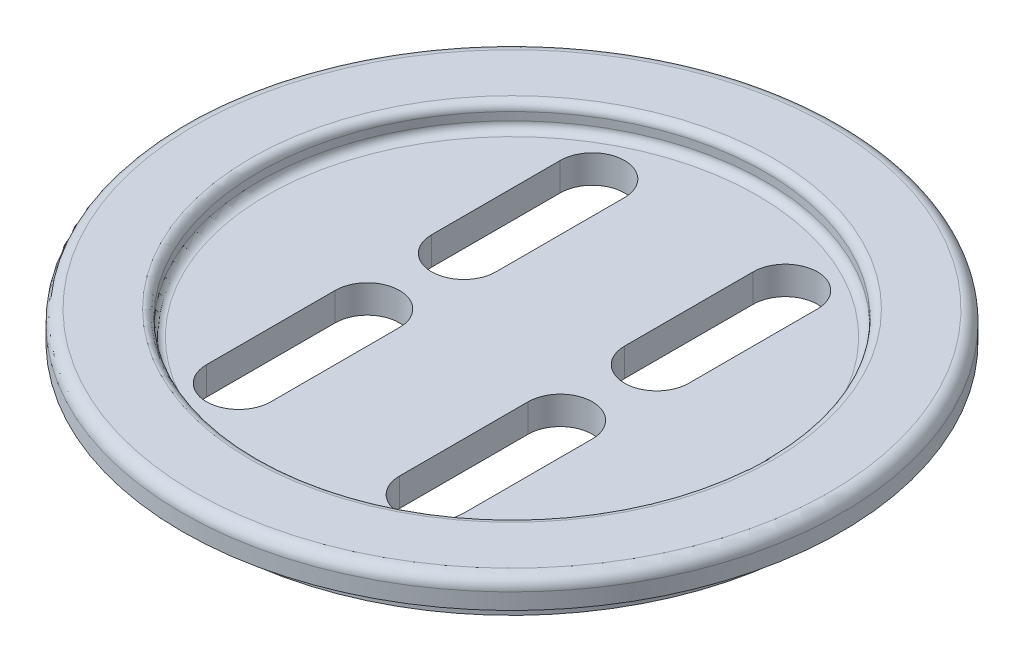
ISO-10303-21;
HEADER;
FILE_DESCRIPTION(('STEP AP214'),'2;1');
FILE_NAME('part.step','',(''),(''),'','','');
FILE_SCHEMA(('AUTOMOTIVE_DESIGN { 1 0 10303 214 1 1 1 1 }'));
ENDSEC;
DATA;
#1=APPLICATION_CONTEXT('core data for automotive mechanical design processes');
#2=APPLICATION_PROTOCOL_DEFINITION('international standard','automotive_design',2000,#1);
#3=PRODUCT_CONTEXT('',#1,'mechanical');
#4=PRODUCT('Part','Part','',(#3));
#5=PRODUCT_RELATED_PRODUCT_CATEGORY('part','',(#4));
#6=PRODUCT_DEFINITION_FORMATION('','',#4);
#7=PRODUCT_DEFINITION_CONTEXT('part definition',#1,'design');
#8=PRODUCT_DEFINITION('design','',#6,#7);
#9=PRODUCT_DEFINITION_SHAPE('','',#8);
#10=(LENGTH_UNIT() NAMED_UNIT(*) SI_UNIT(.MILLI.,.METRE.));
#11=(NAMED_UNIT(*) PLANE_ANGLE_UNIT() SI_UNIT($,.RADIAN.));
#12=(NAMED_UNIT(*) SI_UNIT($,.STERADIAN.) SOLID_ANGLE_UNIT());
#13=UNCERTAINTY_MEASURE_WITH_UNIT(LENGTH_MEASURE(1.E-05),#10,'distance_accuracy_value','');
#14=(GEOMETRIC_REPRESENTATION_CONTEXT(3) GLOBAL_UNCERTAINTY_ASSIGNED_CONTEXT((#13)) GLOBAL_UNIT_ASSIGNED_CONTEXT((#10,
#11,#12)) REPRESENTATION_CONTEXT('',''));
#15=CARTESIAN_POINT('',(0.,0.,0.));
#16=DIRECTION('',(0.,0.,1.));
#17=DIRECTION('',(1.,0.,0.));
#18=AXIS2_PLACEMENT_3D('',#15,#16,#17);
#19=CARTESIAN_POINT('',(0.,0.,0.));
#20=DIRECTION('',(0.,1.,0.));
#21=DIRECTION('',(0.,0.,1.));
#22=AXIS2_PLACEMENT_3D('',#19,#20,#21);
#23=PLANE('',#22);
#24=CARTESIAN_POINT('',(0.,0.,0.));
#25=DIRECTION('',(0.,1.,0.));
#26=DIRECTION('',(0.,0.,1.));
#27=AXIS2_PLACEMENT_3D('',#24,#25,#26);
#28=CIRCLE('',#27,41.);
#29=CARTESIAN_POINT('',(0.,0.,41.));
#30=VERTEX_POINT('',#29);
#31=EDGE_CURVE('E282',#30,#30,#28,.T.);
#32=ORIENTED_EDGE('',*,*,#31,.F.);
#33=EDGE_LOOP('',(#32));
#34=FACE_BOUND('',#33,.T.);
#35=CARTESIAN_POINT('',(0.,0.,0.));
#36=DIRECTION('',(0.,1.,0.));
#37=DIRECTION('',(0.,0.,1.));
#38=AXIS2_PLACEMENT_3D('',#35,#36,#37);
#39=CIRCLE('',#38,37.5);
#40=CARTESIAN_POINT('',(0.,0.,37.5));
#41=VERTEX_POINT('',#40);
#42=EDGE_CURVE('E285',#41,#41,#39,.F.);
#43=ORIENTED_EDGE('',*,*,#42,.F.);
#44=EDGE_LOOP('',(#43));
#45=FACE_BOUND('',#44,.T.);
#46=ADVANCED_FACE('F34',(#34,#45),#23,.F.);
#47=CARTESIAN_POINT('',(0.,3.5,0.));
#48=DIRECTION('',(0.,-1.,0.));
#49=DIRECTION('',(0.,0.,-1.));
#50=AXIS2_PLACEMENT_3D('',#47,#48,#49);
#51=CYLINDRICAL_SURFACE('',#50,41.);
#52=CARTESIAN_POINT('',(0.,2.,0.));
#53=DIRECTION('',(0.,1.,0.));
#54=DIRECTION('',(0.,0.,1.));
#55=AXIS2_PLACEMENT_3D('',#52,#53,#54);
#56=CIRCLE('',#55,41.);
#57=CARTESIAN_POINT('',(0.,2.,41.));
#58=VERTEX_POINT('',#57);
#59=EDGE_CURVE('E291',#58,#58,#56,.F.);
#60=ORIENTED_EDGE('',*,*,#59,.T.);
#61=EDGE_LOOP('',(#60));
#62=FACE_BOUND('',#61,.T.);
#63=ORIENTED_EDGE('',*,*,#31,.T.);
#64=EDGE_LOOP('',(#63));
#65=FACE_BOUND('',#64,.T.);
#66=ADVANCED_FACE('F363',(#62,#65),#51,.T.);
#67=CARTESIAN_POINT('',(0.,3.5,0.));
#68=DIRECTION('',(0.,1.,0.));
#69=DIRECTION('',(0.,0.,1.));
#70=AXIS2_PLACEMENT_3D('',#67,#68,#69);
#71=PLANE('',#70);
#72=CARTESIAN_POINT('',(0.,3.5,0.));
#73=DIRECTION('',(0.,1.,0.));
#74=DIRECTION('',(0.,0.,1.));
#75=AXIS2_PLACEMENT_3D('',#72,#73,#74);
#76=CIRCLE('',#75,32.5);
#77=CARTESIAN_POINT('',(0.,3.5,32.5));
#78=VERTEX_POINT('',#77);
#79=EDGE_CURVE('E42',#78,#78,#76,.F.);
#80=ORIENTED_EDGE('',*,*,#79,.T.);
#81=EDGE_LOOP('',(#80));
#82=FACE_BOUND('',#81,.T.);
#83=CARTESIAN_POINT('',(0.,3.5,0.));
#84=DIRECTION('',(0.,1.,0.));
#85=DIRECTION('',(0.,0.,1.));
#86=AXIS2_PLACEMENT_3D('',#83,#84,#85);
#87=CIRCLE('',#86,39.5);
#88=CARTESIAN_POINT('',(0.,3.5,39.5));
#89=VERTEX_POINT('',#88);
#90=EDGE_CURVE('E288',#89,#89,#87,.T.);
#91=ORIENTED_EDGE('',*,*,#90,.T.);
#92=EDGE_LOOP('',(#91));
#93=FACE_BOUND('',#92,.T.);
#94=ADVANCED_FACE('F302',(#82,#93),#71,.T.);
#95=CARTESIAN_POINT('',(0.,-3.,0.));
#96=DIRECTION('',(0.,1.,0.));
#97=DIRECTION('',(0.,0.,1.));
#98=AXIS2_PLACEMENT_3D('',#95,#96,#97);
#99=CYLINDRICAL_SURFACE('',#98,37.5);
#100=CARTESIAN_POINT('',(0.,-3.,0.));
#101=DIRECTION('',(0.,-1.,0.));
#102=DIRECTION('',(0.,0.,-1.));
#103=AXIS2_PLACEMENT_3D('',#100,#101,#102);
#104=CIRCLE('',#103,37.5);
#105=CARTESIAN_POINT('',(0.,-3.,-37.5));
#106=VERTEX_POINT('',#105);
#107=EDGE_CURVE('E273',#106,#106,#104,.T.);
#108=ORIENTED_EDGE('',*,*,#107,.F.);
#109=EDGE_LOOP('',(#108));
#110=FACE_BOUND('',#109,.T.);
#111=ORIENTED_EDGE('',*,*,#42,.T.);
#112=EDGE_LOOP('',(#111));
#113=FACE_BOUND('',#112,.T.);
#114=ADVANCED_FACE('F387',(#110,#113),#99,.T.);
#115=CARTESIAN_POINT('',(0.,-3.,0.));
#116=DIRECTION('',(0.,-1.,0.));
#117=DIRECTION('',(0.,0.,-1.));
#118=AXIS2_PLACEMENT_3D('',#115,#116,#117);
#119=PLANE('',#118);
#120=CARTESIAN_POINT('',(12.,-3.,6.));
#121=DIRECTION('',(0.,1.,0.));
#122=DIRECTION('',(0.,0.,1.));
#123=AXIS2_PLACEMENT_3D('',#120,#121,#122);
#124=CIRCLE('',#123,4.);
#125=CARTESIAN_POINT('',(16.,-3.,6.));
#126=VERTEX_POINT('',#125);
#127=CARTESIAN_POINT('',(8.00000000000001,-3.,6.));
#128=VERTEX_POINT('',#127);
#129=EDGE_CURVE('E149',#126,#128,#124,.T.);
#130=ORIENTED_EDGE('',*,*,#129,.T.);
#131=DIRECTION('',(0.,0.,1.));
#132=VECTOR('',#131,1.);
#133=CARTESIAN_POINT('',(8.00000000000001,-3.,6.));
#134=LINE('',#133,#132);
#135=CARTESIAN_POINT('',(8.00000000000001,-3.,22.));
#136=VERTEX_POINT('',#135);
#137=EDGE_CURVE('E158',#128,#136,#134,.T.);
#138=ORIENTED_EDGE('',*,*,#137,.T.);
#139=CARTESIAN_POINT('',(12.,-3.,22.));
#140=DIRECTION('',(0.,1.,0.));
#141=DIRECTION('',(0.,0.,1.));
#142=AXIS2_PLACEMENT_3D('',#139,#140,#141);
#143=CIRCLE('',#142,4.);
#144=CARTESIAN_POINT('',(16.,-3.,22.));
#145=VERTEX_POINT('',#144);
#146=EDGE_CURVE('E49',#136,#145,#143,.T.);
#147=ORIENTED_EDGE('',*,*,#146,.T.);
#148=DIRECTION('',(0.,0.,-1.));
#149=VECTOR('',#148,1.);
#150=CARTESIAN_POINT('',(16.,-3.,22.));
#151=LINE('',#150,#149);
#152=EDGE_CURVE('E155',#145,#126,#151,.T.);
#153=ORIENTED_EDGE('',*,*,#152,.T.);
#154=EDGE_LOOP('',(#130,#138,#147,#153));
#155=FACE_BOUND('',#154,.T.);
#156=CARTESIAN_POINT('',(-12.,-3.,6.));
#157=DIRECTION('',(0.,1.,0.));
#158=DIRECTION('',(0.,0.,-1.));
#159=AXIS2_PLACEMENT_3D('',#156,#157,#158);
#160=CIRCLE('',#159,4.);
#161=CARTESIAN_POINT('',(-8.00000000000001,-3.,6.));
#162=VERTEX_POINT('',#161);
#163=CARTESIAN_POINT('',(-16.,-3.,6.));
#164=VERTEX_POINT('',#163);
#165=EDGE_CURVE('E184',#162,#164,#160,.T.);
#166=ORIENTED_EDGE('',*,*,#165,.T.);
#167=DIRECTION('',(0.,0.,1.));
#168=VECTOR('',#167,1.);
#169=CARTESIAN_POINT('',(-16.,-3.,22.));
#170=LINE('',#169,#168);
#171=CARTESIAN_POINT('',(-16.,-3.,22.));
#172=VERTEX_POINT('',#171);
#173=EDGE_CURVE('E187',#164,#172,#170,.T.);
#174=ORIENTED_EDGE('',*,*,#173,.T.);
#175=CARTESIAN_POINT('',(-12.,-3.,22.));
#176=DIRECTION('',(0.,1.,0.));
#177=DIRECTION('',(0.,0.,-1.));
#178=AXIS2_PLACEMENT_3D('',#175,#176,#177);
#179=CIRCLE('',#178,4.);
#180=CARTESIAN_POINT('',(-8.00000000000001,-3.,22.));
#181=VERTEX_POINT('',#180);
#182=EDGE_CURVE('E191',#172,#181,#179,.T.);
#183=ORIENTED_EDGE('',*,*,#182,.T.);
#184=DIRECTION('',(0.,0.,-1.));
#185=VECTOR('',#184,1.);
#186=CARTESIAN_POINT('',(-8.00000000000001,-3.,6.));
#187=LINE('',#186,#185);
#188=EDGE_CURVE('E194',#181,#162,#187,.T.);
#189=ORIENTED_EDGE('',*,*,#188,.T.);
#190=EDGE_LOOP('',(#166,#174,#183,#189));
#191=FACE_BOUND('',#190,.T.);
#192=CARTESIAN_POINT('',(-12.,-3.,-6.));
#193=DIRECTION('',(0.,1.,0.));
#194=DIRECTION('',(0.,0.,1.));
#195=AXIS2_PLACEMENT_3D('',#192,#193,#194);
#196=CIRCLE('',#195,3.99999999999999);
#197=CARTESIAN_POINT('',(-16.,-3.,-6.));
#198=VERTEX_POINT('',#197);
#199=CARTESIAN_POINT('',(-8.00000000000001,-3.,-6.));
#200=VERTEX_POINT('',#199);
#201=EDGE_CURVE('E216',#198,#200,#196,.T.);
#202=ORIENTED_EDGE('',*,*,#201,.T.);
#203=DIRECTION('',(0.,0.,-1.));
#204=VECTOR('',#203,1.);
#205=CARTESIAN_POINT('',(-8.00000000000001,-3.,-6.));
#206=LINE('',#205,#204);
#207=CARTESIAN_POINT('',(-8.00000000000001,-3.,-22.));
#208=VERTEX_POINT('',#207);
#209=EDGE_CURVE('E219',#200,#208,#206,.T.);
#210=ORIENTED_EDGE('',*,*,#209,.T.);
#211=CARTESIAN_POINT('',(-12.,-3.,-22.));
#212=DIRECTION('',(0.,1.,0.));
#213=DIRECTION('',(0.,0.,1.));
#214=AXIS2_PLACEMENT_3D('',#211,#212,#213);
#215=CIRCLE('',#214,4.);
#216=CARTESIAN_POINT('',(-16.,-3.,-22.));
#217=VERTEX_POINT('',#216);
#218=EDGE_CURVE('E223',#208,#217,#215,.T.);
#219=ORIENTED_EDGE('',*,*,#218,.T.);
#220=DIRECTION('',(0.,0.,1.));
#221=VECTOR('',#220,1.);
#222=CARTESIAN_POINT('',(-16.,-3.,-22.));
#223=LINE('',#222,#221);
#224=EDGE_CURVE('E226',#217,#198,#223,.T.);
#225=ORIENTED_EDGE('',*,*,#224,.T.);
#226=EDGE_LOOP('',(#202,#210,#219,#225));
#227=FACE_BOUND('',#226,.T.);
#228=CARTESIAN_POINT('',(12.,-3.,-6.));
#229=DIRECTION('',(0.,1.,0.));
#230=DIRECTION('',(0.,0.,-1.));
#231=AXIS2_PLACEMENT_3D('',#228,#229,#230);
#232=CIRCLE('',#231,3.99999999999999);
#233=CARTESIAN_POINT('',(8.00000000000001,-3.,-6.));
#234=VERTEX_POINT('',#233);
#235=CARTESIAN_POINT('',(16.,-3.,-6.));
#236=VERTEX_POINT('',#235);
#237=EDGE_CURVE('E248',#234,#236,#232,.T.);
#238=ORIENTED_EDGE('',*,*,#237,.T.);
#239=DIRECTION('',(0.,0.,-1.));
#240=VECTOR('',#239,1.);
#241=CARTESIAN_POINT('',(16.,-3.,-22.));
#242=LINE('',#241,#240);
#243=CARTESIAN_POINT('',(16.,-3.,-22.));
#244=VERTEX_POINT('',#243);
#245=EDGE_CURVE('E251',#236,#244,#242,.T.);
#246=ORIENTED_EDGE('',*,*,#245,.T.);
#247=CARTESIAN_POINT('',(12.,-3.,-22.));
#248=DIRECTION('',(0.,1.,0.));
#249=DIRECTION('',(0.,0.,-1.));
#250=AXIS2_PLACEMENT_3D('',#247,#248,#249);
#251=CIRCLE('',#250,4.);
#252=CARTESIAN_POINT('',(8.00000000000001,-3.,-22.));
#253=VERTEX_POINT('',#252);
#254=EDGE_CURVE('E255',#244,#253,#251,.T.);
#255=ORIENTED_EDGE('',*,*,#254,.T.);
#256=DIRECTION('',(0.,0.,1.));
#257=VECTOR('',#256,1.);
#258=CARTESIAN_POINT('',(8.00000000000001,-3.,-6.));
#259=LINE('',#258,#257);
#260=EDGE_CURVE('E258',#253,#234,#259,.T.);
#261=ORIENTED_EDGE('',*,*,#260,.T.);
#262=EDGE_LOOP('',(#238,#246,#255,#261));
#263=FACE_BOUND('',#262,.T.);
#264=ORIENTED_EDGE('',*,*,#107,.T.);
#265=EDGE_LOOP('',(#264));
#266=FACE_BOUND('',#265,.T.);
#267=ADVANCED_FACE('F162',(#155,#191,#227,#263,#266),#119,.T.);
#268=CARTESIAN_POINT('',(0.,0.5,0.));
#269=DIRECTION('',(0.,1.,0.));
#270=DIRECTION('',(0.,0.,1.));
#271=AXIS2_PLACEMENT_3D('',#268,#269,#270);
#272=CYLINDRICAL_SURFACE('',#271,31.5);
#273=CARTESIAN_POINT('',(0.,2.5,0.));
#274=DIRECTION('',(0.,1.,0.));
#275=DIRECTION('',(0.,0.,1.));
#276=AXIS2_PLACEMENT_3D('',#273,#274,#275);
#277=CIRCLE('',#276,31.5);
#278=CARTESIAN_POINT('',(0.,2.5,31.5));
#279=VERTEX_POINT('',#278);
#280=EDGE_CURVE('E297',#279,#279,#277,.T.);
#281=ORIENTED_EDGE('',*,*,#280,.T.);
#282=EDGE_LOOP('',(#281));
#283=FACE_BOUND('',#282,.T.);
#284=CARTESIAN_POINT('',(0.,1.5,0.));
#285=DIRECTION('',(0.,1.,0.));
#286=DIRECTION('',(0.,0.,1.));
#287=AXIS2_PLACEMENT_3D('',#284,#285,#286);
#288=CIRCLE('',#287,31.5);
#289=CARTESIAN_POINT('',(0.,1.5,31.5));
#290=VERTEX_POINT('',#289);
#291=EDGE_CURVE('E294',#290,#290,#288,.F.);
#292=ORIENTED_EDGE('',*,*,#291,.T.);
#293=EDGE_LOOP('',(#292));
#294=FACE_BOUND('',#293,.T.);
#295=ADVANCED_FACE('F311',(#283,#294),#272,.F.);
#296=CARTESIAN_POINT('',(0.,0.5,0.));
#297=DIRECTION('',(0.,1.,0.));
#298=DIRECTION('',(0.,0.,1.));
#299=AXIS2_PLACEMENT_3D('',#296,#297,#298);
#300=PLANE('',#299);
#301=CARTESIAN_POINT('',(0.,0.5,0.));
#302=DIRECTION('',(0.,1.,0.));
#303=DIRECTION('',(0.,0.,1.));
#304=AXIS2_PLACEMENT_3D('',#301,#302,#303);
#305=CIRCLE('',#304,30.5);
#306=CARTESIAN_POINT('',(0.,0.5,30.5));
#307=VERTEX_POINT('',#306);
#308=EDGE_CURVE('E11',#307,#307,#305,.T.);
#309=ORIENTED_EDGE('',*,*,#308,.T.);
#310=EDGE_LOOP('',(#309));
#311=FACE_BOUND('',#310,.T.);
#312=CARTESIAN_POINT('',(12.,0.5,6.));
#313=DIRECTION('',(0.,1.,0.));
#314=DIRECTION('',(0.,0.,1.));
#315=AXIS2_PLACEMENT_3D('',#312,#313,#314);
#316=CIRCLE('',#315,4.);
#317=CARTESIAN_POINT('',(16.,0.5,6.));
#318=VERTEX_POINT('',#317);
#319=CARTESIAN_POINT('',(8.00000000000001,0.5,6.));
#320=VERTEX_POINT('',#319);
#321=EDGE_CURVE('E57',#318,#320,#316,.T.);
#322=ORIENTED_EDGE('',*,*,#321,.F.);
#323=DIRECTION('',(0.,0.,-1.));
#324=VECTOR('',#323,1.);
#325=CARTESIAN_POINT('',(16.,0.5,22.));
#326=LINE('',#325,#324);
#327=CARTESIAN_POINT('',(16.,0.5,22.));
#328=VERTEX_POINT('',#327);
#329=EDGE_CURVE('E165',#328,#318,#326,.T.);
#330=ORIENTED_EDGE('',*,*,#329,.F.);
#331=CARTESIAN_POINT('',(12.,0.5,22.));
#332=DIRECTION('',(0.,1.,0.));
#333=DIRECTION('',(0.,0.,1.));
#334=AXIS2_PLACEMENT_3D('',#331,#332,#333);
#335=CIRCLE('',#334,4.);
#336=CARTESIAN_POINT('',(8.00000000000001,0.5,22.));
#337=VERTEX_POINT('',#336);
#338=EDGE_CURVE('E168',#337,#328,#335,.T.);
#339=ORIENTED_EDGE('',*,*,#338,.F.);
#340=DIRECTION('',(0.,0.,1.));
#341=VECTOR('',#340,1.);
#342=CARTESIAN_POINT('',(8.00000000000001,0.5,6.));
#343=LINE('',#342,#341);
#344=EDGE_CURVE('E174',#320,#337,#343,.T.);
#345=ORIENTED_EDGE('',*,*,#344,.F.);
#346=EDGE_LOOP('',(#322,#330,#339,#345));
#347=FACE_BOUND('',#346,.T.);
#348=CARTESIAN_POINT('',(-12.,0.5,6.));
#349=DIRECTION('',(0.,1.,0.));
#350=DIRECTION('',(0.,0.,-1.));
#351=AXIS2_PLACEMENT_3D('',#348,#349,#350);
#352=CIRCLE('',#351,4.);
#353=CARTESIAN_POINT('',(-8.00000000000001,0.5,6.));
#354=VERTEX_POINT('',#353);
#355=CARTESIAN_POINT('',(-16.,0.5,6.));
#356=VERTEX_POINT('',#355);
#357=EDGE_CURVE('E180',#354,#356,#352,.T.);
#358=ORIENTED_EDGE('',*,*,#357,.F.);
#359=DIRECTION('',(0.,0.,-1.));
#360=VECTOR('',#359,1.);
#361=CARTESIAN_POINT('',(-8.00000000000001,0.5,6.));
#362=LINE('',#361,#360);
#363=CARTESIAN_POINT('',(-8.00000000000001,0.5,22.));
#364=VERTEX_POINT('',#363);
#365=EDGE_CURVE('E188',#364,#354,#362,.T.);
#366=ORIENTED_EDGE('',*,*,#365,.F.);
#367=CARTESIAN_POINT('',(-12.,0.5,22.));
#368=DIRECTION('',(0.,1.,0.));
#369=DIRECTION('',(0.,0.,-1.));
#370=AXIS2_PLACEMENT_3D('',#367,#368,#369);
#371=CIRCLE('',#370,4.);
#372=CARTESIAN_POINT('',(-16.,0.5,22.));
#373=VERTEX_POINT('',#372);
#374=EDGE_CURVE('E202',#373,#364,#371,.T.);
#375=ORIENTED_EDGE('',*,*,#374,.F.);
#376=DIRECTION('',(0.,0.,1.));
#377=VECTOR('',#376,1.);
#378=CARTESIAN_POINT('',(-16.,0.5,22.));
#379=LINE('',#378,#377);
#380=EDGE_CURVE('E199',#356,#373,#379,.T.);
#381=ORIENTED_EDGE('',*,*,#380,.F.);
#382=EDGE_LOOP('',(#358,#366,#375,#381));
#383=FACE_BOUND('',#382,.T.);
#384=CARTESIAN_POINT('',(-12.,0.5,-6.));
#385=DIRECTION('',(0.,1.,0.));
#386=DIRECTION('',(0.,0.,1.));
#387=AXIS2_PLACEMENT_3D('',#384,#385,#386);
#388=CIRCLE('',#387,3.99999999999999);
#389=CARTESIAN_POINT('',(-16.,0.5,-6.));
#390=VERTEX_POINT('',#389);
#391=CARTESIAN_POINT('',(-8.00000000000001,0.5,-6.));
#392=VERTEX_POINT('',#391);
#393=EDGE_CURVE('E209',#390,#392,#388,.T.);
#394=ORIENTED_EDGE('',*,*,#393,.F.);
#395=DIRECTION('',(0.,0.,1.));
#396=VECTOR('',#395,1.);
#397=CARTESIAN_POINT('',(-16.,0.5,-22.));
#398=LINE('',#397,#396);
#399=CARTESIAN_POINT('',(-16.,0.5,-22.));
#400=VERTEX_POINT('',#399);
#401=EDGE_CURVE('E220',#400,#390,#398,.T.);
#402=ORIENTED_EDGE('',*,*,#401,.F.);
#403=CARTESIAN_POINT('',(-12.,0.5,-22.));
#404=DIRECTION('',(0.,1.,0.));
#405=DIRECTION('',(0.,0.,1.));
#406=AXIS2_PLACEMENT_3D('',#403,#404,#405);
#407=CIRCLE('',#406,4.);
#408=CARTESIAN_POINT('',(-8.00000000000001,0.5,-22.));
#409=VERTEX_POINT('',#408);
#410=EDGE_CURVE('E234',#409,#400,#407,.T.);
#411=ORIENTED_EDGE('',*,*,#410,.F.);
#412=DIRECTION('',(0.,0.,-1.));
#413=VECTOR('',#412,1.);
#414=CARTESIAN_POINT('',(-8.00000000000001,0.5,-6.));
#415=LINE('',#414,#413);
#416=EDGE_CURVE('E231',#392,#409,#415,.T.);
#417=ORIENTED_EDGE('',*,*,#416,.F.);
#418=EDGE_LOOP('',(#394,#402,#411,#417));
#419=FACE_BOUND('',#418,.T.);
#420=CARTESIAN_POINT('',(12.,0.5,-6.));
#421=DIRECTION('',(0.,1.,0.));
#422=DIRECTION('',(0.,0.,-1.));
#423=AXIS2_PLACEMENT_3D('',#420,#421,#422);
#424=CIRCLE('',#423,3.99999999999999);
#425=CARTESIAN_POINT('',(8.00000000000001,0.5,-6.));
#426=VERTEX_POINT('',#425);
#427=CARTESIAN_POINT('',(16.,0.5,-6.));
#428=VERTEX_POINT('',#427);
#429=EDGE_CURVE('E241',#426,#428,#424,.T.);
#430=ORIENTED_EDGE('',*,*,#429,.F.);
#431=DIRECTION('',(0.,0.,1.));
#432=VECTOR('',#431,1.);
#433=CARTESIAN_POINT('',(8.00000000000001,0.5,-6.));
#434=LINE('',#433,#432);
#435=CARTESIAN_POINT('',(8.00000000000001,0.5,-22.));
#436=VERTEX_POINT('',#435);
#437=EDGE_CURVE('E252',#436,#426,#434,.T.);
#438=ORIENTED_EDGE('',*,*,#437,.F.);
#439=CARTESIAN_POINT('',(12.,0.5,-22.));
#440=DIRECTION('',(0.,1.,0.));
#441=DIRECTION('',(0.,0.,-1.));
#442=AXIS2_PLACEMENT_3D('',#439,#440,#441);
#443=CIRCLE('',#442,4.);
#444=CARTESIAN_POINT('',(16.,0.5,-22.));
#445=VERTEX_POINT('',#444);
#446=EDGE_CURVE('E266',#445,#436,#443,.T.);
#447=ORIENTED_EDGE('',*,*,#446,.F.);
#448=DIRECTION('',(0.,0.,-1.));
#449=VECTOR('',#448,1.);
#450=CARTESIAN_POINT('',(16.,0.5,-22.));
#451=LINE('',#450,#449);
#452=EDGE_CURVE('E263',#428,#445,#451,.T.);
#453=ORIENTED_EDGE('',*,*,#452,.F.);
#454=EDGE_LOOP('',(#430,#438,#447,#453));
#455=FACE_BOUND('',#454,.T.);
#456=ADVANCED_FACE('F314',(#311,#347,#383,#419,#455),#300,.T.);
#457=CARTESIAN_POINT('',(12.,-3.,-6.));
#458=DIRECTION('',(0.,1.,0.));
#459=DIRECTION('',(0.,0.,1.));
#460=AXIS2_PLACEMENT_3D('',#457,#458,#459);
#461=CYLINDRICAL_SURFACE('',#460,3.99999999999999);
#462=ORIENTED_EDGE('',*,*,#429,.T.);
#463=DIRECTION('',(0.,1.,0.));
#464=VECTOR('',#463,1.);
#465=CARTESIAN_POINT('',(16.,-3.,-6.));
#466=LINE('',#465,#464);
#467=EDGE_CURVE('E261',#236,#428,#466,.T.);
#468=ORIENTED_EDGE('',*,*,#467,.F.);
#469=ORIENTED_EDGE('',*,*,#237,.F.);
#470=DIRECTION('',(0.,1.,0.));
#471=VECTOR('',#470,1.);
#472=CARTESIAN_POINT('',(8.00000000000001,-3.,-6.));
#473=LINE('',#472,#471);
#474=EDGE_CURVE('E271',#234,#426,#473,.T.);
#475=ORIENTED_EDGE('',*,*,#474,.T.);
#476=EDGE_LOOP('',(#462,#468,#469,#475));
#477=FACE_BOUND('',#476,.T.);
#478=ADVANCED_FACE('F324',(#477),#461,.F.);
#479=CARTESIAN_POINT('',(8.00000000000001,-3.,-6.));
#480=DIRECTION('',(-1.,0.,0.));
#481=DIRECTION('',(0.,0.,1.));
#482=AXIS2_PLACEMENT_3D('',#479,#480,#481);
#483=PLANE('',#482);
#484=ORIENTED_EDGE('',*,*,#437,.T.);
#485=ORIENTED_EDGE('',*,*,#474,.F.);
#486=ORIENTED_EDGE('',*,*,#260,.F.);
#487=DIRECTION('',(0.,1.,0.));
#488=VECTOR('',#487,1.);
#489=CARTESIAN_POINT('',(8.00000000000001,-3.,-22.));
#490=LINE('',#489,#488);
#491=EDGE_CURVE('E274',#253,#436,#490,.T.);
#492=ORIENTED_EDGE('',*,*,#491,.T.);
#493=EDGE_LOOP('',(#484,#485,#486,#492));
#494=FACE_BOUND('',#493,.T.);
#495=ADVANCED_FACE('F350',(#494),#483,.F.);
#496=CARTESIAN_POINT('',(12.,-3.,-22.));
#497=DIRECTION('',(0.,1.,0.));
#498=DIRECTION('',(0.,0.,1.));
#499=AXIS2_PLACEMENT_3D('',#496,#497,#498);
#500=CYLINDRICAL_SURFACE('',#499,4.);
#501=ORIENTED_EDGE('',*,*,#446,.T.);
#502=ORIENTED_EDGE('',*,*,#491,.F.);
#503=ORIENTED_EDGE('',*,*,#254,.F.);
#504=DIRECTION('',(0.,1.,0.));
#505=VECTOR('',#504,1.);
#506=CARTESIAN_POINT('',(16.,-3.,-22.));
#507=LINE('',#506,#505);
#508=EDGE_CURVE('E276',#244,#445,#507,.T.);
#509=ORIENTED_EDGE('',*,*,#508,.T.);
#510=EDGE_LOOP('',(#501,#502,#503,#509));
#511=FACE_BOUND('',#510,.T.);
#512=ADVANCED_FACE('F352',(#511),#500,.F.);
#513=CARTESIAN_POINT('',(16.,-3.,-22.));
#514=DIRECTION('',(1.,0.,0.));
#515=DIRECTION('',(0.,0.,-1.));
#516=AXIS2_PLACEMENT_3D('',#513,#514,#515);
#517=PLANE('',#516);
#518=ORIENTED_EDGE('',*,*,#452,.T.);
#519=ORIENTED_EDGE('',*,*,#508,.F.);
#520=ORIENTED_EDGE('',*,*,#245,.F.);
#521=ORIENTED_EDGE('',*,*,#467,.T.);
#522=EDGE_LOOP('',(#518,#519,#520,#521));
#523=FACE_BOUND('',#522,.T.);
#524=ADVANCED_FACE('F344',(#523),#517,.F.);
#525=CARTESIAN_POINT('',(-12.,-3.,-6.));
#526=DIRECTION('',(0.,1.,0.));
#527=DIRECTION('',(0.,0.,1.));
#528=AXIS2_PLACEMENT_3D('',#525,#526,#527);
#529=CYLINDRICAL_SURFACE('',#528,3.99999999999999);
#530=ORIENTED_EDGE('',*,*,#393,.T.);
#531=DIRECTION('',(0.,1.,0.));
#532=VECTOR('',#531,1.);
#533=CARTESIAN_POINT('',(-8.00000000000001,-3.,-6.));
#534=LINE('',#533,#532);
#535=EDGE_CURVE('E229',#200,#392,#534,.T.);
#536=ORIENTED_EDGE('',*,*,#535,.F.);
#537=ORIENTED_EDGE('',*,*,#201,.F.);
#538=DIRECTION('',(0.,1.,0.));
#539=VECTOR('',#538,1.);
#540=CARTESIAN_POINT('',(-16.,-3.,-6.));
#541=LINE('',#540,#539);
#542=EDGE_CURVE('E239',#198,#390,#541,.T.);
#543=ORIENTED_EDGE('',*,*,#542,.T.);
#544=EDGE_LOOP('',(#530,#536,#537,#543));
#545=FACE_BOUND('',#544,.T.);
#546=ADVANCED_FACE('F359',(#545),#529,.F.);
#547=CARTESIAN_POINT('',(-16.,-3.,-22.));
#548=DIRECTION('',(-1.,0.,0.));
#549=DIRECTION('',(0.,0.,1.));
#550=AXIS2_PLACEMENT_3D('',#547,#548,#549);
#551=PLANE('',#550);
#552=ORIENTED_EDGE('',*,*,#401,.T.);
#553=ORIENTED_EDGE('',*,*,#542,.F.);
#554=ORIENTED_EDGE('',*,*,#224,.F.);
#555=DIRECTION('',(0.,1.,0.));
#556=VECTOR('',#555,1.);
#557=CARTESIAN_POINT('',(-16.,-3.,-22.));
#558=LINE('',#557,#556);
#559=EDGE_CURVE('E242',#217,#400,#558,.T.);
#560=ORIENTED_EDGE('',*,*,#559,.T.);
#561=EDGE_LOOP('',(#552,#553,#554,#560));
#562=FACE_BOUND('',#561,.T.);
#563=ADVANCED_FACE('F428',(#562),#551,.F.);
#564=CARTESIAN_POINT('',(-12.,-3.,-22.));
#565=DIRECTION('',(0.,1.,0.));
#566=DIRECTION('',(0.,0.,1.));
#567=AXIS2_PLACEMENT_3D('',#564,#565,#566);
#568=CYLINDRICAL_SURFACE('',#567,4.);
#569=ORIENTED_EDGE('',*,*,#410,.T.);
#570=ORIENTED_EDGE('',*,*,#559,.F.);
#571=ORIENTED_EDGE('',*,*,#218,.F.);
#572=DIRECTION('',(0.,1.,0.));
#573=VECTOR('',#572,1.);
#574=CARTESIAN_POINT('',(-8.00000000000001,-3.,-22.));
#575=LINE('',#574,#573);
#576=EDGE_CURVE('E244',#208,#409,#575,.T.);
#577=ORIENTED_EDGE('',*,*,#576,.T.);
#578=EDGE_LOOP('',(#569,#570,#571,#577));
#579=FACE_BOUND('',#578,.T.);
#580=ADVANCED_FACE('F438',(#579),#568,.F.);
#581=CARTESIAN_POINT('',(-8.00000000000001,-3.,-6.));
#582=DIRECTION('',(1.,0.,0.));
#583=DIRECTION('',(0.,0.,-1.));
#584=AXIS2_PLACEMENT_3D('',#581,#582,#583);
#585=PLANE('',#584);
#586=ORIENTED_EDGE('',*,*,#416,.T.);
#587=ORIENTED_EDGE('',*,*,#576,.F.);
#588=ORIENTED_EDGE('',*,*,#209,.F.);
#589=ORIENTED_EDGE('',*,*,#535,.T.);
#590=EDGE_LOOP('',(#586,#587,#588,#589));
#591=FACE_BOUND('',#590,.T.);
#592=ADVANCED_FACE('F448',(#591),#585,.F.);
#593=CARTESIAN_POINT('',(-12.,-3.,6.));
#594=DIRECTION('',(0.,1.,0.));
#595=DIRECTION('',(0.,0.,1.));
#596=AXIS2_PLACEMENT_3D('',#593,#594,#595);
#597=CYLINDRICAL_SURFACE('',#596,4.);
#598=ORIENTED_EDGE('',*,*,#357,.T.);
#599=DIRECTION('',(0.,1.,0.));
#600=VECTOR('',#599,1.);
#601=CARTESIAN_POINT('',(-16.,-3.,6.));
#602=LINE('',#601,#600);
#603=EDGE_CURVE('E197',#164,#356,#602,.T.);
#604=ORIENTED_EDGE('',*,*,#603,.F.);
#605=ORIENTED_EDGE('',*,*,#165,.F.);
#606=DIRECTION('',(0.,1.,0.));
#607=VECTOR('',#606,1.);
#608=CARTESIAN_POINT('',(-8.00000000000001,-3.,6.));
#609=LINE('',#608,#607);
#610=EDGE_CURVE('E207',#162,#354,#609,.T.);
#611=ORIENTED_EDGE('',*,*,#610,.T.);
#612=EDGE_LOOP('',(#598,#604,#605,#611));
#613=FACE_BOUND('',#612,.T.);
#614=ADVANCED_FACE('F458',(#613),#597,.F.);
#615=CARTESIAN_POINT('',(-8.00000000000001,-3.,6.));
#616=DIRECTION('',(1.,0.,0.));
#617=DIRECTION('',(0.,0.,-1.));
#618=AXIS2_PLACEMENT_3D('',#615,#616,#617);
#619=PLANE('',#618);
#620=ORIENTED_EDGE('',*,*,#365,.T.);
#621=ORIENTED_EDGE('',*,*,#610,.F.);
#622=ORIENTED_EDGE('',*,*,#188,.F.);
#623=DIRECTION('',(0.,1.,0.));
#624=VECTOR('',#623,1.);
#625=CARTESIAN_POINT('',(-8.00000000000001,-3.,22.));
#626=LINE('',#625,#624);
#627=EDGE_CURVE('E210',#181,#364,#626,.T.);
#628=ORIENTED_EDGE('',*,*,#627,.T.);
#629=EDGE_LOOP('',(#620,#621,#622,#628));
#630=FACE_BOUND('',#629,.T.);
#631=ADVANCED_FACE('F468',(#630),#619,.F.);
#632=CARTESIAN_POINT('',(-12.,-3.,22.));
#633=DIRECTION('',(0.,1.,0.));
#634=DIRECTION('',(0.,0.,1.));
#635=AXIS2_PLACEMENT_3D('',#632,#633,#634);
#636=CYLINDRICAL_SURFACE('',#635,4.);
#637=ORIENTED_EDGE('',*,*,#374,.T.);
#638=ORIENTED_EDGE('',*,*,#627,.F.);
#639=ORIENTED_EDGE('',*,*,#182,.F.);
#640=DIRECTION('',(0.,1.,0.));
#641=VECTOR('',#640,1.);
#642=CARTESIAN_POINT('',(-16.,-3.,22.));
#643=LINE('',#642,#641);
#644=EDGE_CURVE('E212',#172,#373,#643,.T.);
#645=ORIENTED_EDGE('',*,*,#644,.T.);
#646=EDGE_LOOP('',(#637,#638,#639,#645));
#647=FACE_BOUND('',#646,.T.);
#648=ADVANCED_FACE('F478',(#647),#636,.F.);
#649=CARTESIAN_POINT('',(-16.,-3.,22.));
#650=DIRECTION('',(-1.,0.,0.));
#651=DIRECTION('',(0.,0.,1.));
#652=AXIS2_PLACEMENT_3D('',#649,#650,#651);
#653=PLANE('',#652);
#654=ORIENTED_EDGE('',*,*,#380,.T.);
#655=ORIENTED_EDGE('',*,*,#644,.F.);
#656=ORIENTED_EDGE('',*,*,#173,.F.);
#657=ORIENTED_EDGE('',*,*,#603,.T.);
#658=EDGE_LOOP('',(#654,#655,#656,#657));
#659=FACE_BOUND('',#658,.T.);
#660=ADVANCED_FACE('F488',(#659),#653,.F.);
#661=CARTESIAN_POINT('',(12.,-3.,6.));
#662=DIRECTION('',(0.,1.,0.));
#663=DIRECTION('',(0.,0.,1.));
#664=AXIS2_PLACEMENT_3D('',#661,#662,#663);
#665=CYLINDRICAL_SURFACE('',#664,4.);
#666=ORIENTED_EDGE('',*,*,#321,.T.);
#667=DIRECTION('',(0.,1.,0.));
#668=VECTOR('',#667,1.);
#669=CARTESIAN_POINT('',(8.00000000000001,-3.,6.));
#670=LINE('',#669,#668);
#671=EDGE_CURVE('E145',#128,#320,#670,.T.);
#672=ORIENTED_EDGE('',*,*,#671,.F.);
#673=ORIENTED_EDGE('',*,*,#129,.F.);
#674=DIRECTION('',(0.,1.,0.));
#675=VECTOR('',#674,1.);
#676=CARTESIAN_POINT('',(16.,-3.,6.));
#677=LINE('',#676,#675);
#678=EDGE_CURVE('E178',#126,#318,#677,.T.);
#679=ORIENTED_EDGE('',*,*,#678,.T.);
#680=EDGE_LOOP('',(#666,#672,#673,#679));
#681=FACE_BOUND('',#680,.T.);
#682=ADVANCED_FACE('F147',(#681),#665,.F.);
#683=CARTESIAN_POINT('',(16.,-3.,22.));
#684=DIRECTION('',(1.,0.,0.));
#685=DIRECTION('',(0.,0.,-1.));
#686=AXIS2_PLACEMENT_3D('',#683,#684,#685);
#687=PLANE('',#686);
#688=ORIENTED_EDGE('',*,*,#329,.T.);
#689=ORIENTED_EDGE('',*,*,#678,.F.);
#690=ORIENTED_EDGE('',*,*,#152,.F.);
#691=DIRECTION('',(0.,1.,0.));
#692=VECTOR('',#691,1.);
#693=CARTESIAN_POINT('',(16.,-3.,22.));
#694=LINE('',#693,#692);
#695=EDGE_CURVE('E181',#145,#328,#694,.T.);
#696=ORIENTED_EDGE('',*,*,#695,.T.);
#697=EDGE_LOOP('',(#688,#689,#690,#696));
#698=FACE_BOUND('',#697,.T.);
#699=ADVANCED_FACE('F507',(#698),#687,.F.);
#700=CARTESIAN_POINT('',(12.,-3.,22.));
#701=DIRECTION('',(0.,1.,0.));
#702=DIRECTION('',(0.,0.,1.));
#703=AXIS2_PLACEMENT_3D('',#700,#701,#702);
#704=CYLINDRICAL_SURFACE('',#703,4.);
#705=ORIENTED_EDGE('',*,*,#338,.T.);
#706=ORIENTED_EDGE('',*,*,#695,.F.);
#707=ORIENTED_EDGE('',*,*,#146,.F.);
#708=DIRECTION('',(0.,1.,0.));
#709=VECTOR('',#708,1.);
#710=CARTESIAN_POINT('',(8.00000000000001,-3.,22.));
#711=LINE('',#710,#709);
#712=EDGE_CURVE('E154',#136,#337,#711,.T.);
#713=ORIENTED_EDGE('',*,*,#712,.T.);
#714=EDGE_LOOP('',(#705,#706,#707,#713));
#715=FACE_BOUND('',#714,.T.);
#716=ADVANCED_FACE('F381',(#715),#704,.F.);
#717=CARTESIAN_POINT('',(8.00000000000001,-3.,6.));
#718=DIRECTION('',(-1.,0.,0.));
#719=DIRECTION('',(0.,0.,1.));
#720=AXIS2_PLACEMENT_3D('',#717,#718,#719);
#721=PLANE('',#720);
#722=ORIENTED_EDGE('',*,*,#344,.T.);
#723=ORIENTED_EDGE('',*,*,#712,.F.);
#724=ORIENTED_EDGE('',*,*,#137,.F.);
#725=ORIENTED_EDGE('',*,*,#671,.T.);
#726=EDGE_LOOP('',(#722,#723,#724,#725));
#727=FACE_BOUND('',#726,.T.);
#728=ADVANCED_FACE('F159',(#727),#721,.F.);
#729=CARTESIAN_POINT('',(0.,2.,0.));
#730=DIRECTION('',(0.,1.,0.));
#731=DIRECTION('',(0.,0.,1.));
#732=AXIS2_PLACEMENT_3D('',#729,#730,#731);
#733=TOROIDAL_SURFACE('',#732,39.5,1.5);
#734=ORIENTED_EDGE('',*,*,#59,.F.);
#735=EDGE_LOOP('',(#734));
#736=FACE_BOUND('',#735,.T.);
#737=ORIENTED_EDGE('',*,*,#90,.F.);
#738=EDGE_LOOP('',(#737));
#739=FACE_BOUND('',#738,.T.);
#740=ADVANCED_FACE('F308',(#736,#739),#733,.T.);
#741=CARTESIAN_POINT('',(0.,2.5,0.));
#742=DIRECTION('',(0.,1.,0.));
#743=DIRECTION('',(0.,0.,1.));
#744=AXIS2_PLACEMENT_3D('',#741,#742,#743);
#745=TOROIDAL_SURFACE('',#744,32.5,1.);
#746=ORIENTED_EDGE('',*,*,#79,.F.);
#747=EDGE_LOOP('',(#746));
#748=FACE_BOUND('',#747,.T.);
#749=ORIENTED_EDGE('',*,*,#280,.F.);
#750=EDGE_LOOP('',(#749));
#751=FACE_BOUND('',#750,.T.);
#752=ADVANCED_FACE('F305',(#748,#751),#745,.T.);
#753=CARTESIAN_POINT('',(0.,1.5,0.));
#754=DIRECTION('',(0.,1.,0.));
#755=DIRECTION('',(0.,0.,1.));
#756=AXIS2_PLACEMENT_3D('',#753,#754,#755);
#757=TOROIDAL_SURFACE('',#756,30.5,1.);
#758=ORIENTED_EDGE('',*,*,#291,.F.);
#759=EDGE_LOOP('',(#758));
#760=FACE_BOUND('',#759,.T.);
#761=ORIENTED_EDGE('',*,*,#308,.F.);
#762=EDGE_LOOP('',(#761));
#763=FACE_BOUND('',#762,.T.);
#764=ADVANCED_FACE('F36',(#760,#763),#757,.F.);
#765=CLOSED_SHELL('',(#46,#66,#94,#114,#267,#295,#456,#478,#495,#512,#524,#546,#563,#580,#592,
#614,#631,#648,#660,#682,#699,#716,#728,#740,#752,#764));
#766=MANIFOLD_SOLID_BREP('B2',#765);
#767=ADVANCED_BREP_SHAPE_REPRESENTATION('',(#18,#766),#14);
#768=SHAPE_DEFINITION_REPRESENTATION(#9,#767);
ENDSEC;
END-ISO-10303-21;
